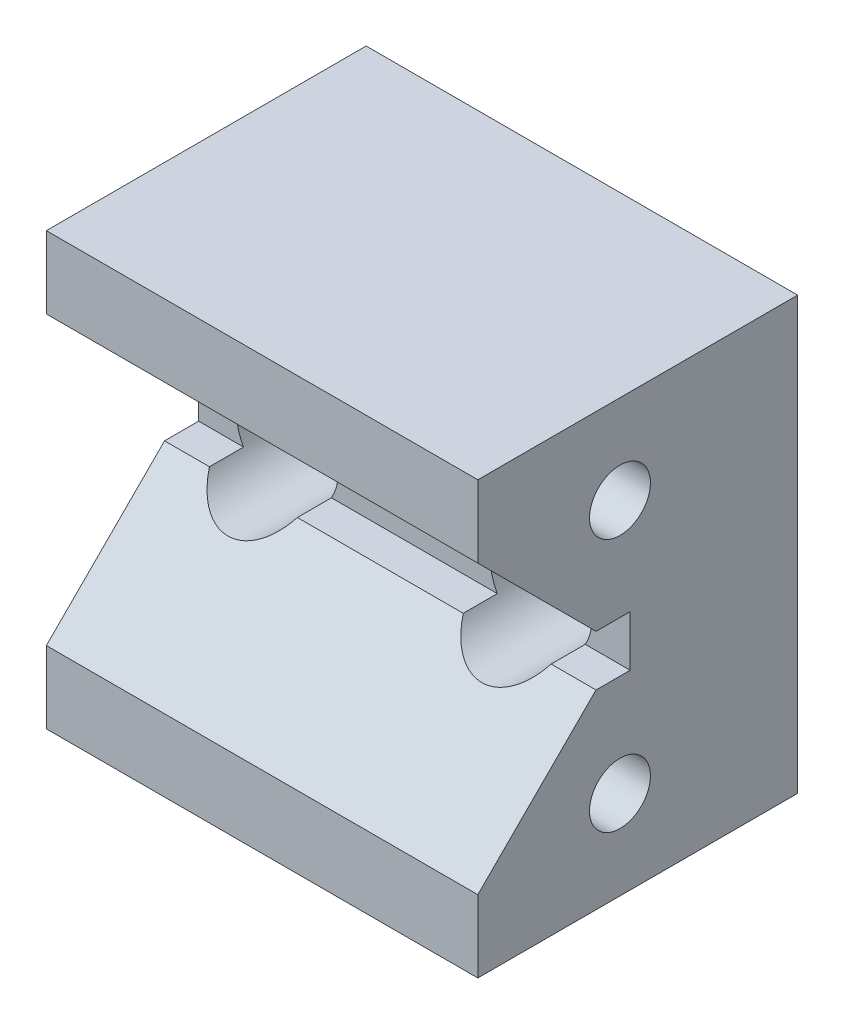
ISO-10303-21;
HEADER;
FILE_DESCRIPTION(('STEP AP214'),'2;1');
FILE_NAME('part.step','',(''),(''),'','','');
FILE_SCHEMA(('AUTOMOTIVE_DESIGN { 1 0 10303 214 1 1 1 1 }'));
ENDSEC;
DATA;
#1=APPLICATION_CONTEXT('core data for automotive mechanical design processes');
#2=APPLICATION_PROTOCOL_DEFINITION('international standard','automotive_design',2000,#1);
#3=PRODUCT_CONTEXT('',#1,'mechanical');
#4=PRODUCT('Part','Part','',(#3));
#5=PRODUCT_RELATED_PRODUCT_CATEGORY('part','',(#4));
#6=PRODUCT_DEFINITION_FORMATION('','',#4);
#7=PRODUCT_DEFINITION_CONTEXT('part definition',#1,'design');
#8=PRODUCT_DEFINITION('design','',#6,#7);
#9=PRODUCT_DEFINITION_SHAPE('','',#8);
#10=(LENGTH_UNIT() NAMED_UNIT(*) SI_UNIT(.MILLI.,.METRE.));
#11=(NAMED_UNIT(*) PLANE_ANGLE_UNIT() SI_UNIT($,.RADIAN.));
#12=(NAMED_UNIT(*) SI_UNIT($,.STERADIAN.) SOLID_ANGLE_UNIT());
#13=UNCERTAINTY_MEASURE_WITH_UNIT(LENGTH_MEASURE(1.E-05),#10,'distance_accuracy_value','');
#14=(GEOMETRIC_REPRESENTATION_CONTEXT(3) GLOBAL_UNCERTAINTY_ASSIGNED_CONTEXT((#13)) GLOBAL_UNIT_ASSIGNED_CONTEXT((#10,
#11,#12)) REPRESENTATION_CONTEXT('',''));
#15=CARTESIAN_POINT('',(0.,0.,0.));
#16=DIRECTION('',(0.,0.,1.));
#17=DIRECTION('',(1.,0.,0.));
#18=AXIS2_PLACEMENT_3D('',#15,#16,#17);
#19=CARTESIAN_POINT('',(67.5,-42.5,0.));
#20=DIRECTION('',(0.,0.,1.));
#21=DIRECTION('',(0.,-1.,0.));
#22=AXIS2_PLACEMENT_3D('',#19,#20,#21);
#23=PLANE('',#22);
#24=CARTESIAN_POINT('',(50.,0.,0.));
#25=DIRECTION('',(0.,0.,-1.));
#26=DIRECTION('',(0.,1.,0.));
#27=AXIS2_PLACEMENT_3D('',#24,#25,#26);
#28=CIRCLE('',#27,6.);
#29=CARTESIAN_POINT('',(50.,6.,0.));
#30=VERTEX_POINT('',#29);
#31=EDGE_CURVE('E272',#30,#30,#28,.T.);
#32=ORIENTED_EDGE('',*,*,#31,.F.);
#33=EDGE_LOOP('',(#32));
#34=FACE_BOUND('',#33,.T.);
#35=DIRECTION('',(-1.,0.,0.));
#36=VECTOR('',#35,1.);
#37=CARTESIAN_POINT('',(67.5,42.5,0.));
#38=LINE('',#37,#36);
#39=CARTESIAN_POINT('',(67.5,42.5,0.));
#40=VERTEX_POINT('',#39);
#41=CARTESIAN_POINT('',(-17.5,42.5,0.));
#42=VERTEX_POINT('',#41);
#43=EDGE_CURVE('E178',#40,#42,#38,.T.);
#44=ORIENTED_EDGE('',*,*,#43,.F.);
#45=DIRECTION('',(0.,1.,0.));
#46=VECTOR('',#45,1.);
#47=CARTESIAN_POINT('',(67.5,-42.5,0.));
#48=LINE('',#47,#46);
#49=CARTESIAN_POINT('',(67.5,-42.5,0.));
#50=VERTEX_POINT('',#49);
#51=EDGE_CURVE('E235',#50,#40,#48,.T.);
#52=ORIENTED_EDGE('',*,*,#51,.F.);
#53=DIRECTION('',(-1.,0.,0.));
#54=VECTOR('',#53,1.);
#55=CARTESIAN_POINT('',(67.5,-42.5,0.));
#56=LINE('',#55,#54);
#57=CARTESIAN_POINT('',(-17.5,-42.5,0.));
#58=VERTEX_POINT('',#57);
#59=EDGE_CURVE('E180',#50,#58,#56,.T.);
#60=ORIENTED_EDGE('',*,*,#59,.T.);
#61=DIRECTION('',(0.,1.,0.));
#62=VECTOR('',#61,1.);
#63=CARTESIAN_POINT('',(-17.5,-42.5,0.));
#64=LINE('',#63,#62);
#65=EDGE_CURVE('E207',#58,#42,#64,.T.);
#66=ORIENTED_EDGE('',*,*,#65,.T.);
#67=EDGE_LOOP('',(#44,#52,#60,#66));
#68=FACE_BOUND('',#67,.T.);
#69=CARTESIAN_POINT('',(0.,0.,0.));
#70=DIRECTION('',(0.,0.,-1.));
#71=DIRECTION('',(0.,1.,0.));
#72=AXIS2_PLACEMENT_3D('',#69,#70,#71);
#73=CIRCLE('',#72,6.);
#74=CARTESIAN_POINT('',(0.,6.,0.));
#75=VERTEX_POINT('',#74);
#76=EDGE_CURVE('E310',#75,#75,#73,.T.);
#77=ORIENTED_EDGE('',*,*,#76,.F.);
#78=EDGE_LOOP('',(#77));
#79=FACE_BOUND('',#78,.T.);
#80=ADVANCED_FACE('F14',(#34,#68,#79),#23,.F.);
#81=CARTESIAN_POINT('',(67.5,28.284,63.));
#82=DIRECTION('',(0.,0.707106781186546,-0.707106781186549));
#83=DIRECTION('',(0.,0.707106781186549,0.707106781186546));
#84=AXIS2_PLACEMENT_3D('',#81,#82,#83);
#85=PLANE('',#84);
#86=CARTESIAN_POINT('',(0.,0.,34.716));
#87=DIRECTION('',(0.,0.707106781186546,-0.707106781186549));
#88=DIRECTION('',(0.,-0.707106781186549,-0.707106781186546));
#89=AXIS2_PLACEMENT_3D('',#86,#87,#88);
#90=ELLIPSE('',#89,14.1421356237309,10.);
#91=CARTESIAN_POINT('',(8.6602540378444,5.,39.716));
#92=VERTEX_POINT('',#91);
#93=CARTESIAN_POINT('',(-8.6602540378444,5.,39.716));
#94=VERTEX_POINT('',#93);
#95=EDGE_CURVE('E328',#92,#94,#90,.F.);
#96=ORIENTED_EDGE('',*,*,#95,.F.);
#97=DIRECTION('',(-1.,0.,0.));
#98=VECTOR('',#97,1.);
#99=CARTESIAN_POINT('',(67.5,5.,39.716));
#100=LINE('',#99,#98);
#101=CARTESIAN_POINT('',(41.3397459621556,5.,39.716));
#102=VERTEX_POINT('',#101);
#103=EDGE_CURVE('E174',#102,#92,#100,.T.);
#104=ORIENTED_EDGE('',*,*,#103,.F.);
#105=CARTESIAN_POINT('',(50.,0.,34.716));
#106=DIRECTION('',(0.,0.707106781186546,-0.707106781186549));
#107=DIRECTION('',(0.,-0.707106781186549,-0.707106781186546));
#108=AXIS2_PLACEMENT_3D('',#105,#106,#107);
#109=ELLIPSE('',#108,14.1421356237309,10.);
#110=CARTESIAN_POINT('',(58.6602540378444,5.,39.716));
#111=VERTEX_POINT('',#110);
#112=EDGE_CURVE('E201',#111,#102,#109,.F.);
#113=ORIENTED_EDGE('',*,*,#112,.F.);
#114=CARTESIAN_POINT('',(67.5,5.,39.716));
#115=VERTEX_POINT('',#114);
#116=EDGE_CURVE('E170',#115,#111,#100,.T.);
#117=ORIENTED_EDGE('',*,*,#116,.F.);
#118=DIRECTION('',(0.,-0.707106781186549,-0.707106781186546));
#119=VECTOR('',#118,1.);
#120=CARTESIAN_POINT('',(67.5,28.284,63.));
#121=LINE('',#120,#119);
#122=CARTESIAN_POINT('',(67.5,28.284,63.));
#123=VERTEX_POINT('',#122);
#124=EDGE_CURVE('E244',#123,#115,#121,.T.);
#125=ORIENTED_EDGE('',*,*,#124,.F.);
#126=DIRECTION('',(-1.,0.,0.));
#127=VECTOR('',#126,1.);
#128=CARTESIAN_POINT('',(67.5,28.284,63.));
#129=LINE('',#128,#127);
#130=CARTESIAN_POINT('',(-17.5,28.284,63.));
#131=VERTEX_POINT('',#130);
#132=EDGE_CURVE('E173',#123,#131,#129,.T.);
#133=ORIENTED_EDGE('',*,*,#132,.T.);
#134=DIRECTION('',(0.,-0.707106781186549,-0.707106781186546));
#135=VECTOR('',#134,1.);
#136=CARTESIAN_POINT('',(-17.5,28.284,63.));
#137=LINE('',#136,#135);
#138=CARTESIAN_POINT('',(-17.5,5.,39.716));
#139=VERTEX_POINT('',#138);
#140=EDGE_CURVE('E221',#131,#139,#137,.T.);
#141=ORIENTED_EDGE('',*,*,#140,.T.);
#142=EDGE_CURVE('E168',#94,#139,#100,.T.);
#143=ORIENTED_EDGE('',*,*,#142,.F.);
#144=EDGE_LOOP('',(#96,#104,#113,#117,#125,#133,#141,#143));
#145=FACE_BOUND('',#144,.T.);
#146=ADVANCED_FACE('F289',(#145),#85,.F.);
#147=CARTESIAN_POINT('',(67.5,5.,33.));
#148=DIRECTION('',(0.,-1.,0.));
#149=DIRECTION('',(0.,0.,-1.));
#150=AXIS2_PLACEMENT_3D('',#147,#148,#149);
#151=PLANE('',#150);
#152=DIRECTION('',(-1.,0.,0.));
#153=VECTOR('',#152,1.);
#154=CARTESIAN_POINT('',(67.5,5.,33.));
#155=LINE('',#154,#153);
#156=CARTESIAN_POINT('',(-8.6602540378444,5.,33.));
#157=VERTEX_POINT('',#156);
#158=CARTESIAN_POINT('',(-17.5,5.,33.));
#159=VERTEX_POINT('',#158);
#160=EDGE_CURVE('E164',#157,#159,#155,.T.);
#161=ORIENTED_EDGE('',*,*,#160,.F.);
#162=DIRECTION('',(0.,0.,-1.));
#163=VECTOR('',#162,1.);
#164=CARTESIAN_POINT('',(-8.6602540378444,5.,0.));
#165=LINE('',#164,#163);
#166=EDGE_CURVE('E325',#157,#94,#165,.F.);
#167=ORIENTED_EDGE('',*,*,#166,.T.);
#168=ORIENTED_EDGE('',*,*,#142,.T.);
#169=DIRECTION('',(0.,0.,1.));
#170=VECTOR('',#169,1.);
#171=CARTESIAN_POINT('',(-17.5,5.,33.));
#172=LINE('',#171,#170);
#173=EDGE_CURVE('E224',#159,#139,#172,.T.);
#174=ORIENTED_EDGE('',*,*,#173,.F.);
#175=EDGE_LOOP('',(#161,#167,#168,#174));
#176=FACE_BOUND('',#175,.T.);
#177=ADVANCED_FACE('F378',(#176),#151,.T.);
#178=ORIENTED_EDGE('',*,*,#103,.T.);
#179=DIRECTION('',(0.,0.,-1.));
#180=VECTOR('',#179,1.);
#181=CARTESIAN_POINT('',(8.6602540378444,5.,0.));
#182=LINE('',#181,#180);
#183=CARTESIAN_POINT('',(8.66025403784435,5.,33.));
#184=VERTEX_POINT('',#183);
#185=EDGE_CURVE('E322',#92,#184,#182,.T.);
#186=ORIENTED_EDGE('',*,*,#185,.T.);
#187=CARTESIAN_POINT('',(41.3397459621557,5.,33.));
#188=VERTEX_POINT('',#187);
#189=EDGE_CURVE('E169',#188,#184,#155,.T.);
#190=ORIENTED_EDGE('',*,*,#189,.F.);
#191=DIRECTION('',(0.,0.,-1.));
#192=VECTOR('',#191,1.);
#193=CARTESIAN_POINT('',(41.3397459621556,5.,0.));
#194=LINE('',#193,#192);
#195=EDGE_CURVE('E278',#188,#102,#194,.F.);
#196=ORIENTED_EDGE('',*,*,#195,.T.);
#197=EDGE_LOOP('',(#178,#186,#190,#196));
#198=FACE_BOUND('',#197,.T.);
#199=ADVANCED_FACE('F376',(#198),#151,.T.);
#200=CARTESIAN_POINT('',(67.5,-5.,33.));
#201=DIRECTION('',(0.,0.,1.));
#202=DIRECTION('',(0.,-1.,0.));
#203=AXIS2_PLACEMENT_3D('',#200,#201,#202);
#204=PLANE('',#203);
#205=DIRECTION('',(-1.,0.,0.));
#206=VECTOR('',#205,1.);
#207=CARTESIAN_POINT('',(67.5,-5.,33.));
#208=LINE('',#207,#206);
#209=CARTESIAN_POINT('',(-8.6602540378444,-5.,33.));
#210=VERTEX_POINT('',#209);
#211=CARTESIAN_POINT('',(-17.5,-5.,33.));
#212=VERTEX_POINT('',#211);
#213=EDGE_CURVE('E156',#210,#212,#208,.T.);
#214=ORIENTED_EDGE('',*,*,#213,.F.);
#215=CARTESIAN_POINT('',(0.,0.,33.));
#216=DIRECTION('',(0.,0.,1.));
#217=DIRECTION('',(0.,-1.,0.));
#218=AXIS2_PLACEMENT_3D('',#215,#216,#217);
#219=CIRCLE('',#218,10.);
#220=EDGE_CURVE('E321',#210,#157,#219,.F.);
#221=ORIENTED_EDGE('',*,*,#220,.T.);
#222=ORIENTED_EDGE('',*,*,#160,.T.);
#223=DIRECTION('',(0.,1.,0.));
#224=VECTOR('',#223,1.);
#225=CARTESIAN_POINT('',(-17.5,-5.,33.));
#226=LINE('',#225,#224);
#227=EDGE_CURVE('E227',#212,#159,#226,.T.);
#228=ORIENTED_EDGE('',*,*,#227,.F.);
#229=EDGE_LOOP('',(#214,#221,#222,#228));
#230=FACE_BOUND('',#229,.T.);
#231=ADVANCED_FACE('F372',(#230),#204,.T.);
#232=ORIENTED_EDGE('',*,*,#189,.T.);
#233=CARTESIAN_POINT('',(8.66025403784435,-5.,33.));
#234=VERTEX_POINT('',#233);
#235=EDGE_CURVE('E149',#184,#234,#219,.F.);
#236=ORIENTED_EDGE('',*,*,#235,.T.);
#237=CARTESIAN_POINT('',(41.3397459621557,-5.,33.));
#238=VERTEX_POINT('',#237);
#239=EDGE_CURVE('E148',#238,#234,#208,.T.);
#240=ORIENTED_EDGE('',*,*,#239,.F.);
#241=CARTESIAN_POINT('',(50.,0.,33.));
#242=DIRECTION('',(0.,0.,1.));
#243=DIRECTION('',(0.,-1.,0.));
#244=AXIS2_PLACEMENT_3D('',#241,#242,#243);
#245=CIRCLE('',#244,10.);
#246=EDGE_CURVE('E270',#238,#188,#245,.F.);
#247=ORIENTED_EDGE('',*,*,#246,.T.);
#248=EDGE_LOOP('',(#232,#236,#240,#247));
#249=FACE_BOUND('',#248,.T.);
#250=ADVANCED_FACE('F375',(#249),#204,.T.);
#251=CARTESIAN_POINT('',(67.5,-5.,39.716));
#252=DIRECTION('',(0.,1.,0.));
#253=DIRECTION('',(0.,0.,1.));
#254=AXIS2_PLACEMENT_3D('',#251,#252,#253);
#255=PLANE('',#254);
#256=ORIENTED_EDGE('',*,*,#239,.T.);
#257=DIRECTION('',(0.,0.,-1.));
#258=VECTOR('',#257,1.);
#259=CARTESIAN_POINT('',(8.66025403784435,-5.,0.));
#260=LINE('',#259,#258);
#261=CARTESIAN_POINT('',(8.66025403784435,-5.,39.716));
#262=VERTEX_POINT('',#261);
#263=EDGE_CURVE('E137',#234,#262,#260,.F.);
#264=ORIENTED_EDGE('',*,*,#263,.T.);
#265=DIRECTION('',(-1.,0.,0.));
#266=VECTOR('',#265,1.);
#267=CARTESIAN_POINT('',(67.5,-5.,39.716));
#268=LINE('',#267,#266);
#269=CARTESIAN_POINT('',(41.3397459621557,-5.,39.716));
#270=VERTEX_POINT('',#269);
#271=EDGE_CURVE('E146',#270,#262,#268,.T.);
#272=ORIENTED_EDGE('',*,*,#271,.F.);
#273=DIRECTION('',(0.,0.,-1.));
#274=VECTOR('',#273,1.);
#275=CARTESIAN_POINT('',(41.3397459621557,-5.,0.));
#276=LINE('',#275,#274);
#277=EDGE_CURVE('E36',#270,#238,#276,.T.);
#278=ORIENTED_EDGE('',*,*,#277,.T.);
#279=EDGE_LOOP('',(#256,#264,#272,#278));
#280=FACE_BOUND('',#279,.T.);
#281=ADVANCED_FACE('F145',(#280),#255,.T.);
#282=CARTESIAN_POINT('',(-8.6602540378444,-5.,39.716));
#283=VERTEX_POINT('',#282);
#284=CARTESIAN_POINT('',(-17.5,-5.,39.716));
#285=VERTEX_POINT('',#284);
#286=EDGE_CURVE('E154',#283,#285,#268,.T.);
#287=ORIENTED_EDGE('',*,*,#286,.F.);
#288=DIRECTION('',(0.,0.,-1.));
#289=VECTOR('',#288,1.);
#290=CARTESIAN_POINT('',(-8.6602540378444,-5.,0.));
#291=LINE('',#290,#289);
#292=EDGE_CURVE('E29',#283,#210,#291,.T.);
#293=ORIENTED_EDGE('',*,*,#292,.T.);
#294=ORIENTED_EDGE('',*,*,#213,.T.);
#295=DIRECTION('',(0.,0.,-1.));
#296=VECTOR('',#295,1.);
#297=CARTESIAN_POINT('',(-17.5,-5.,39.716));
#298=LINE('',#297,#296);
#299=EDGE_CURVE('E230',#285,#212,#298,.T.);
#300=ORIENTED_EDGE('',*,*,#299,.F.);
#301=EDGE_LOOP('',(#287,#293,#294,#300));
#302=FACE_BOUND('',#301,.T.);
#303=ADVANCED_FACE('F368',(#302),#255,.T.);
#304=CARTESIAN_POINT('',(67.5,-28.284,63.));
#305=DIRECTION('',(0.,0.707106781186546,0.707106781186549));
#306=DIRECTION('',(0.,-0.707106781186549,0.707106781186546));
#307=AXIS2_PLACEMENT_3D('',#304,#305,#306);
#308=PLANE('',#307);
#309=ORIENTED_EDGE('',*,*,#271,.T.);
#310=CARTESIAN_POINT('',(0.,0.,34.716));
#311=DIRECTION('',(0.,0.707106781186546,0.707106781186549));
#312=DIRECTION('',(0.,0.707106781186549,-0.707106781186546));
#313=AXIS2_PLACEMENT_3D('',#310,#311,#312);
#314=ELLIPSE('',#313,14.1421356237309,10.);
#315=EDGE_CURVE('E9',#262,#283,#314,.F.);
#316=ORIENTED_EDGE('',*,*,#315,.T.);
#317=ORIENTED_EDGE('',*,*,#286,.T.);
#318=DIRECTION('',(0.,0.707106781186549,-0.707106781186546));
#319=VECTOR('',#318,1.);
#320=CARTESIAN_POINT('',(-17.5,-28.284,63.));
#321=LINE('',#320,#319);
#322=CARTESIAN_POINT('',(-17.5,-28.284,63.));
#323=VERTEX_POINT('',#322);
#324=EDGE_CURVE('E200',#323,#285,#321,.T.);
#325=ORIENTED_EDGE('',*,*,#324,.F.);
#326=DIRECTION('',(-1.,0.,0.));
#327=VECTOR('',#326,1.);
#328=CARTESIAN_POINT('',(67.5,-28.284,63.));
#329=LINE('',#328,#327);
#330=CARTESIAN_POINT('',(67.5,-28.284,63.));
#331=VERTEX_POINT('',#330);
#332=EDGE_CURVE('E157',#331,#323,#329,.T.);
#333=ORIENTED_EDGE('',*,*,#332,.F.);
#334=DIRECTION('',(0.,0.707106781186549,-0.707106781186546));
#335=VECTOR('',#334,1.);
#336=CARTESIAN_POINT('',(67.5,-28.284,63.));
#337=LINE('',#336,#335);
#338=CARTESIAN_POINT('',(67.5,-5.,39.716));
#339=VERTEX_POINT('',#338);
#340=EDGE_CURVE('E210',#331,#339,#337,.T.);
#341=ORIENTED_EDGE('',*,*,#340,.T.);
#342=CARTESIAN_POINT('',(58.6602540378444,-5.,39.716));
#343=VERTEX_POINT('',#342);
#344=EDGE_CURVE('E153',#339,#343,#268,.T.);
#345=ORIENTED_EDGE('',*,*,#344,.T.);
#346=CARTESIAN_POINT('',(50.,0.,34.716));
#347=DIRECTION('',(0.,0.707106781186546,0.707106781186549));
#348=DIRECTION('',(0.,0.707106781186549,-0.707106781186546));
#349=AXIS2_PLACEMENT_3D('',#346,#347,#348);
#350=ELLIPSE('',#349,14.1421356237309,10.);
#351=EDGE_CURVE('E22',#343,#270,#350,.F.);
#352=ORIENTED_EDGE('',*,*,#351,.T.);
#353=EDGE_LOOP('',(#309,#316,#317,#325,#333,#341,#345,#352));
#354=FACE_BOUND('',#353,.T.);
#355=ADVANCED_FACE('F151',(#354),#308,.T.);
#356=ORIENTED_EDGE('',*,*,#116,.T.);
#357=DIRECTION('',(0.,0.,-1.));
#358=VECTOR('',#357,1.);
#359=CARTESIAN_POINT('',(58.6602540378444,5.,0.));
#360=LINE('',#359,#358);
#361=CARTESIAN_POINT('',(58.6602540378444,5.,33.));
#362=VERTEX_POINT('',#361);
#363=EDGE_CURVE('E276',#111,#362,#360,.T.);
#364=ORIENTED_EDGE('',*,*,#363,.T.);
#365=CARTESIAN_POINT('',(67.5,5.,33.));
#366=VERTEX_POINT('',#365);
#367=EDGE_CURVE('E165',#366,#362,#155,.T.);
#368=ORIENTED_EDGE('',*,*,#367,.F.);
#369=DIRECTION('',(0.,0.,1.));
#370=VECTOR('',#369,1.);
#371=CARTESIAN_POINT('',(67.5,5.,33.));
#372=LINE('',#371,#370);
#373=EDGE_CURVE('E247',#366,#115,#372,.T.);
#374=ORIENTED_EDGE('',*,*,#373,.T.);
#375=EDGE_LOOP('',(#356,#364,#368,#374));
#376=FACE_BOUND('',#375,.T.);
#377=ADVANCED_FACE('F292',(#376),#151,.T.);
#378=ORIENTED_EDGE('',*,*,#367,.T.);
#379=CARTESIAN_POINT('',(58.6602540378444,-5.,33.));
#380=VERTEX_POINT('',#379);
#381=EDGE_CURVE('E268',#362,#380,#245,.F.);
#382=ORIENTED_EDGE('',*,*,#381,.T.);
#383=CARTESIAN_POINT('',(67.5,-5.,33.));
#384=VERTEX_POINT('',#383);
#385=EDGE_CURVE('E161',#384,#380,#208,.T.);
#386=ORIENTED_EDGE('',*,*,#385,.F.);
#387=DIRECTION('',(0.,1.,0.));
#388=VECTOR('',#387,1.);
#389=CARTESIAN_POINT('',(67.5,-5.,33.));
#390=LINE('',#389,#388);
#391=EDGE_CURVE('E250',#384,#366,#390,.T.);
#392=ORIENTED_EDGE('',*,*,#391,.T.);
#393=EDGE_LOOP('',(#378,#382,#386,#392));
#394=FACE_BOUND('',#393,.T.);
#395=ADVANCED_FACE('F371',(#394),#204,.T.);
#396=ORIENTED_EDGE('',*,*,#385,.T.);
#397=DIRECTION('',(0.,0.,-1.));
#398=VECTOR('',#397,1.);
#399=CARTESIAN_POINT('',(58.6602540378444,-5.,0.));
#400=LINE('',#399,#398);
#401=EDGE_CURVE('E266',#380,#343,#400,.F.);
#402=ORIENTED_EDGE('',*,*,#401,.T.);
#403=ORIENTED_EDGE('',*,*,#344,.F.);
#404=DIRECTION('',(0.,0.,-1.));
#405=VECTOR('',#404,1.);
#406=CARTESIAN_POINT('',(67.5,-5.,39.716));
#407=LINE('',#406,#405);
#408=EDGE_CURVE('E253',#339,#384,#407,.T.);
#409=ORIENTED_EDGE('',*,*,#408,.T.);
#410=EDGE_LOOP('',(#396,#402,#403,#409));
#411=FACE_BOUND('',#410,.T.);
#412=ADVANCED_FACE('F264',(#411),#255,.T.);
#413=CARTESIAN_POINT('',(67.5,-42.5,63.));
#414=DIRECTION('',(0.,0.,1.));
#415=DIRECTION('',(0.,-1.,0.));
#416=AXIS2_PLACEMENT_3D('',#413,#414,#415);
#417=PLANE('',#416);
#418=DIRECTION('',(-1.,0.,0.));
#419=VECTOR('',#418,1.);
#420=CARTESIAN_POINT('',(67.5,-42.5,63.));
#421=LINE('',#420,#419);
#422=CARTESIAN_POINT('',(67.5,-42.5,63.));
#423=VERTEX_POINT('',#422);
#424=CARTESIAN_POINT('',(-17.5,-42.5,63.));
#425=VERTEX_POINT('',#424);
#426=EDGE_CURVE('E182',#423,#425,#421,.T.);
#427=ORIENTED_EDGE('',*,*,#426,.F.);
#428=DIRECTION('',(0.,1.,0.));
#429=VECTOR('',#428,1.);
#430=CARTESIAN_POINT('',(67.5,-42.5,63.));
#431=LINE('',#430,#429);
#432=EDGE_CURVE('E208',#423,#331,#431,.T.);
#433=ORIENTED_EDGE('',*,*,#432,.T.);
#434=ORIENTED_EDGE('',*,*,#332,.T.);
#435=DIRECTION('',(0.,1.,0.));
#436=VECTOR('',#435,1.);
#437=CARTESIAN_POINT('',(-17.5,-42.5,63.));
#438=LINE('',#437,#436);
#439=EDGE_CURVE('E195',#425,#323,#438,.T.);
#440=ORIENTED_EDGE('',*,*,#439,.F.);
#441=EDGE_LOOP('',(#427,#433,#434,#440));
#442=FACE_BOUND('',#441,.T.);
#443=ADVANCED_FACE('F196',(#442),#417,.T.);
#444=CARTESIAN_POINT('',(67.5,-42.5,63.));
#445=DIRECTION('',(0.,1.,0.));
#446=DIRECTION('',(0.,0.,1.));
#447=AXIS2_PLACEMENT_3D('',#444,#445,#446);
#448=PLANE('',#447);
#449=ORIENTED_EDGE('',*,*,#59,.F.);
#450=DIRECTION('',(0.,0.,-1.));
#451=VECTOR('',#450,1.);
#452=CARTESIAN_POINT('',(67.5,-42.5,63.));
#453=LINE('',#452,#451);
#454=EDGE_CURVE('E190',#423,#50,#453,.T.);
#455=ORIENTED_EDGE('',*,*,#454,.F.);
#456=ORIENTED_EDGE('',*,*,#426,.T.);
#457=DIRECTION('',(0.,0.,-1.));
#458=VECTOR('',#457,1.);
#459=CARTESIAN_POINT('',(-17.5,-42.5,63.));
#460=LINE('',#459,#458);
#461=EDGE_CURVE('E188',#425,#58,#460,.T.);
#462=ORIENTED_EDGE('',*,*,#461,.T.);
#463=EDGE_LOOP('',(#449,#455,#456,#462));
#464=FACE_BOUND('',#463,.T.);
#465=ADVANCED_FACE('F16',(#464),#448,.F.);
#466=CARTESIAN_POINT('',(67.5,42.5,0.));
#467=DIRECTION('',(0.,-1.,0.));
#468=DIRECTION('',(0.,0.,-1.));
#469=AXIS2_PLACEMENT_3D('',#466,#467,#468);
#470=PLANE('',#469);
#471=DIRECTION('',(-1.,0.,0.));
#472=VECTOR('',#471,1.);
#473=CARTESIAN_POINT('',(67.5,42.5,63.));
#474=LINE('',#473,#472);
#475=CARTESIAN_POINT('',(67.5,42.5,63.));
#476=VERTEX_POINT('',#475);
#477=CARTESIAN_POINT('',(-17.5,42.5,63.));
#478=VERTEX_POINT('',#477);
#479=EDGE_CURVE('E176',#476,#478,#474,.T.);
#480=ORIENTED_EDGE('',*,*,#479,.F.);
#481=DIRECTION('',(0.,0.,1.));
#482=VECTOR('',#481,1.);
#483=CARTESIAN_POINT('',(67.5,42.5,0.));
#484=LINE('',#483,#482);
#485=EDGE_CURVE('E238',#40,#476,#484,.T.);
#486=ORIENTED_EDGE('',*,*,#485,.F.);
#487=ORIENTED_EDGE('',*,*,#43,.T.);
#488=DIRECTION('',(0.,0.,1.));
#489=VECTOR('',#488,1.);
#490=CARTESIAN_POINT('',(-17.5,42.5,0.));
#491=LINE('',#490,#489);
#492=EDGE_CURVE('E211',#42,#478,#491,.T.);
#493=ORIENTED_EDGE('',*,*,#492,.T.);
#494=EDGE_LOOP('',(#480,#486,#487,#493));
#495=FACE_BOUND('',#494,.T.);
#496=ADVANCED_FACE('F302',(#495),#470,.F.);
#497=CARTESIAN_POINT('',(67.5,42.5,63.));
#498=DIRECTION('',(0.,0.,-1.));
#499=DIRECTION('',(0.,1.,0.));
#500=AXIS2_PLACEMENT_3D('',#497,#498,#499);
#501=PLANE('',#500);
#502=ORIENTED_EDGE('',*,*,#132,.F.);
#503=DIRECTION('',(0.,-1.,0.));
#504=VECTOR('',#503,1.);
#505=CARTESIAN_POINT('',(67.5,42.5,63.));
#506=LINE('',#505,#504);
#507=EDGE_CURVE('E241',#476,#123,#506,.T.);
#508=ORIENTED_EDGE('',*,*,#507,.F.);
#509=ORIENTED_EDGE('',*,*,#479,.T.);
#510=DIRECTION('',(0.,-1.,0.));
#511=VECTOR('',#510,1.);
#512=CARTESIAN_POINT('',(-17.5,42.5,63.));
#513=LINE('',#512,#511);
#514=EDGE_CURVE('E218',#478,#131,#513,.T.);
#515=ORIENTED_EDGE('',*,*,#514,.T.);
#516=EDGE_LOOP('',(#502,#508,#509,#515));
#517=FACE_BOUND('',#516,.T.);
#518=ADVANCED_FACE('F299',(#517),#501,.F.);
#519=CARTESIAN_POINT('',(67.5,-42.5,63.));
#520=DIRECTION('',(-1.,0.,0.));
#521=DIRECTION('',(0.,0.,-1.));
#522=AXIS2_PLACEMENT_3D('',#519,#520,#521);
#523=PLANE('',#522);
#524=CARTESIAN_POINT('',(67.5,-25.,35.));
#525=DIRECTION('',(1.,0.,0.));
#526=DIRECTION('',(0.,0.,1.));
#527=AXIS2_PLACEMENT_3D('',#524,#525,#526);
#528=CIRCLE('',#527,6.);
#529=CARTESIAN_POINT('',(67.5,-25.,41.));
#530=VERTEX_POINT('',#529);
#531=EDGE_CURVE('E594',#530,#530,#528,.T.);
#532=ORIENTED_EDGE('',*,*,#531,.F.);
#533=EDGE_LOOP('',(#532));
#534=FACE_BOUND('',#533,.T.);
#535=CARTESIAN_POINT('',(67.5,25.,35.));
#536=DIRECTION('',(1.,0.,0.));
#537=DIRECTION('',(0.,0.,1.));
#538=AXIS2_PLACEMENT_3D('',#535,#536,#537);
#539=CIRCLE('',#538,6.);
#540=CARTESIAN_POINT('',(67.5,25.,41.));
#541=VERTEX_POINT('',#540);
#542=EDGE_CURVE('E593',#541,#541,#539,.T.);
#543=ORIENTED_EDGE('',*,*,#542,.F.);
#544=EDGE_LOOP('',(#543));
#545=FACE_BOUND('',#544,.T.);
#546=ORIENTED_EDGE('',*,*,#432,.F.);
#547=ORIENTED_EDGE('',*,*,#454,.T.);
#548=ORIENTED_EDGE('',*,*,#51,.T.);
#549=ORIENTED_EDGE('',*,*,#485,.T.);
#550=ORIENTED_EDGE('',*,*,#507,.T.);
#551=ORIENTED_EDGE('',*,*,#124,.T.);
#552=ORIENTED_EDGE('',*,*,#373,.F.);
#553=ORIENTED_EDGE('',*,*,#391,.F.);
#554=ORIENTED_EDGE('',*,*,#408,.F.);
#555=ORIENTED_EDGE('',*,*,#340,.F.);
#556=EDGE_LOOP('',(#546,#547,#548,#549,#550,#551,#552,#553,#554,#555));
#557=FACE_BOUND('',#556,.T.);
#558=ADVANCED_FACE('F261',(#534,#545,#557),#523,.F.);
#559=CARTESIAN_POINT('',(-17.5,-42.5,63.));
#560=DIRECTION('',(-1.,0.,0.));
#561=DIRECTION('',(0.,0.,-1.));
#562=AXIS2_PLACEMENT_3D('',#559,#560,#561);
#563=PLANE('',#562);
#564=ORIENTED_EDGE('',*,*,#439,.T.);
#565=ORIENTED_EDGE('',*,*,#324,.T.);
#566=ORIENTED_EDGE('',*,*,#299,.T.);
#567=ORIENTED_EDGE('',*,*,#227,.T.);
#568=ORIENTED_EDGE('',*,*,#173,.T.);
#569=ORIENTED_EDGE('',*,*,#140,.F.);
#570=ORIENTED_EDGE('',*,*,#514,.F.);
#571=ORIENTED_EDGE('',*,*,#492,.F.);
#572=ORIENTED_EDGE('',*,*,#65,.F.);
#573=ORIENTED_EDGE('',*,*,#461,.F.);
#574=EDGE_LOOP('',(#564,#565,#566,#567,#568,#569,#570,#571,#572,#573));
#575=FACE_BOUND('',#574,.T.);
#576=ADVANCED_FACE('F204',(#575),#563,.T.);
#577=CARTESIAN_POINT('',(50.,0.,0.));
#578=DIRECTION('',(0.,0.,-1.));
#579=DIRECTION('',(0.,1.,0.));
#580=AXIS2_PLACEMENT_3D('',#577,#578,#579);
#581=CYLINDRICAL_SURFACE('',#580,10.);
#582=CARTESIAN_POINT('',(50.,0.,22.));
#583=DIRECTION('',(0.,0.,-1.));
#584=DIRECTION('',(0.,1.,0.));
#585=AXIS2_PLACEMENT_3D('',#582,#583,#584);
#586=CIRCLE('',#585,10.);
#587=CARTESIAN_POINT('',(50.,10.,22.));
#588=VERTEX_POINT('',#587);
#589=EDGE_CURVE('E330',#588,#588,#586,.T.);
#590=ORIENTED_EDGE('',*,*,#589,.T.);
#591=EDGE_LOOP('',(#590));
#592=FACE_BOUND('',#591,.T.);
#593=ORIENTED_EDGE('',*,*,#112,.T.);
#594=ORIENTED_EDGE('',*,*,#195,.F.);
#595=ORIENTED_EDGE('',*,*,#246,.F.);
#596=ORIENTED_EDGE('',*,*,#277,.F.);
#597=ORIENTED_EDGE('',*,*,#351,.F.);
#598=ORIENTED_EDGE('',*,*,#401,.F.);
#599=ORIENTED_EDGE('',*,*,#381,.F.);
#600=ORIENTED_EDGE('',*,*,#363,.F.);
#601=EDGE_LOOP('',(#593,#594,#595,#596,#597,#598,#599,#600));
#602=FACE_BOUND('',#601,.T.);
#603=ADVANCED_FACE('F285',(#592,#602),#581,.F.);
#604=CARTESIAN_POINT('',(50.,0.,0.));
#605=DIRECTION('',(0.,0.,-1.));
#606=DIRECTION('',(0.,1.,0.));
#607=AXIS2_PLACEMENT_3D('',#604,#605,#606);
#608=CYLINDRICAL_SURFACE('',#607,6.);
#609=ORIENTED_EDGE('',*,*,#31,.T.);
#610=EDGE_LOOP('',(#609));
#611=FACE_BOUND('',#610,.T.);
#612=CARTESIAN_POINT('',(50.,0.,22.));
#613=DIRECTION('',(0.,0.,-1.));
#614=DIRECTION('',(0.,1.,0.));
#615=AXIS2_PLACEMENT_3D('',#612,#613,#614);
#616=CIRCLE('',#615,6.);
#617=CARTESIAN_POINT('',(50.,6.,22.));
#618=VERTEX_POINT('',#617);
#619=EDGE_CURVE('E333',#618,#618,#616,.T.);
#620=ORIENTED_EDGE('',*,*,#619,.F.);
#621=EDGE_LOOP('',(#620));
#622=FACE_BOUND('',#621,.T.);
#623=ADVANCED_FACE('F338',(#611,#622),#608,.F.);
#624=CARTESIAN_POINT('',(50.,-10.,22.));
#625=DIRECTION('',(0.,0.,1.));
#626=DIRECTION('',(0.,-1.,0.));
#627=AXIS2_PLACEMENT_3D('',#624,#625,#626);
#628=PLANE('',#627);
#629=ORIENTED_EDGE('',*,*,#619,.T.);
#630=EDGE_LOOP('',(#629));
#631=FACE_BOUND('',#630,.T.);
#632=ORIENTED_EDGE('',*,*,#589,.F.);
#633=EDGE_LOOP('',(#632));
#634=FACE_BOUND('',#633,.T.);
#635=ADVANCED_FACE('F341',(#631,#634),#628,.T.);
#636=CARTESIAN_POINT('',(0.,0.,0.));
#637=DIRECTION('',(0.,0.,-1.));
#638=DIRECTION('',(0.,1.,0.));
#639=AXIS2_PLACEMENT_3D('',#636,#637,#638);
#640=CYLINDRICAL_SURFACE('',#639,10.);
#641=CARTESIAN_POINT('',(0.,0.,22.));
#642=DIRECTION('',(0.,0.,-1.));
#643=DIRECTION('',(0.,1.,0.));
#644=AXIS2_PLACEMENT_3D('',#641,#642,#643);
#645=CIRCLE('',#644,10.);
#646=CARTESIAN_POINT('',(0.,10.,22.));
#647=VERTEX_POINT('',#646);
#648=EDGE_CURVE('E316',#647,#647,#645,.T.);
#649=ORIENTED_EDGE('',*,*,#648,.T.);
#650=EDGE_LOOP('',(#649));
#651=FACE_BOUND('',#650,.T.);
#652=ORIENTED_EDGE('',*,*,#95,.T.);
#653=ORIENTED_EDGE('',*,*,#166,.F.);
#654=ORIENTED_EDGE('',*,*,#220,.F.);
#655=ORIENTED_EDGE('',*,*,#292,.F.);
#656=ORIENTED_EDGE('',*,*,#315,.F.);
#657=ORIENTED_EDGE('',*,*,#263,.F.);
#658=ORIENTED_EDGE('',*,*,#235,.F.);
#659=ORIENTED_EDGE('',*,*,#185,.F.);
#660=EDGE_LOOP('',(#652,#653,#654,#655,#656,#657,#658,#659));
#661=FACE_BOUND('',#660,.T.);
#662=ADVANCED_FACE('F136',(#651,#661),#640,.F.);
#663=CARTESIAN_POINT('',(0.,0.,0.));
#664=DIRECTION('',(0.,0.,-1.));
#665=DIRECTION('',(0.,1.,0.));
#666=AXIS2_PLACEMENT_3D('',#663,#664,#665);
#667=CYLINDRICAL_SURFACE('',#666,6.);
#668=ORIENTED_EDGE('',*,*,#76,.T.);
#669=EDGE_LOOP('',(#668));
#670=FACE_BOUND('',#669,.T.);
#671=CARTESIAN_POINT('',(0.,0.,22.));
#672=DIRECTION('',(0.,0.,-1.));
#673=DIRECTION('',(0.,1.,0.));
#674=AXIS2_PLACEMENT_3D('',#671,#672,#673);
#675=CIRCLE('',#674,6.);
#676=CARTESIAN_POINT('',(0.,6.,22.));
#677=VERTEX_POINT('',#676);
#678=EDGE_CURVE('E312',#677,#677,#675,.T.);
#679=ORIENTED_EDGE('',*,*,#678,.F.);
#680=EDGE_LOOP('',(#679));
#681=FACE_BOUND('',#680,.T.);
#682=ADVANCED_FACE('F358',(#670,#681),#667,.F.);
#683=CARTESIAN_POINT('',(0.,-10.,22.));
#684=DIRECTION('',(0.,0.,1.));
#685=DIRECTION('',(0.,-1.,0.));
#686=AXIS2_PLACEMENT_3D('',#683,#684,#685);
#687=PLANE('',#686);
#688=ORIENTED_EDGE('',*,*,#678,.T.);
#689=EDGE_LOOP('',(#688));
#690=FACE_BOUND('',#689,.T.);
#691=ORIENTED_EDGE('',*,*,#648,.F.);
#692=EDGE_LOOP('',(#691));
#693=FACE_BOUND('',#692,.T.);
#694=ADVANCED_FACE('F536',(#690,#693),#687,.T.);
#695=CARTESIAN_POINT('',(37.5,25.,35.));
#696=DIRECTION('',(1.,0.,0.));
#697=DIRECTION('',(0.,0.,1.));
#698=AXIS2_PLACEMENT_3D('',#695,#696,#697);
#699=CYLINDRICAL_SURFACE('',#698,6.);
#700=CARTESIAN_POINT('',(37.5,25.,35.));
#701=DIRECTION('',(1.,0.,0.));
#702=DIRECTION('',(0.,0.,1.));
#703=AXIS2_PLACEMENT_3D('',#700,#701,#702);
#704=CIRCLE('',#703,6.);
#705=CARTESIAN_POINT('',(37.5,25.,41.));
#706=VERTEX_POINT('',#705);
#707=EDGE_CURVE('E597',#706,#706,#704,.T.);
#708=ORIENTED_EDGE('',*,*,#707,.F.);
#709=EDGE_LOOP('',(#708));
#710=FACE_BOUND('',#709,.T.);
#711=ORIENTED_EDGE('',*,*,#542,.T.);
#712=EDGE_LOOP('',(#711));
#713=FACE_BOUND('',#712,.T.);
#714=ADVANCED_FACE('F543',(#710,#713),#699,.F.);
#715=CARTESIAN_POINT('',(37.5,25.,35.));
#716=DIRECTION('',(1.,0.,0.));
#717=DIRECTION('',(0.,0.,1.));
#718=AXIS2_PLACEMENT_3D('',#715,#716,#717);
#719=PLANE('',#718);
#720=ORIENTED_EDGE('',*,*,#707,.T.);
#721=EDGE_LOOP('',(#720));
#722=FACE_BOUND('',#721,.T.);
#723=ADVANCED_FACE('F545',(#722),#719,.T.);
#724=CARTESIAN_POINT('',(37.5,-25.,35.));
#725=DIRECTION('',(1.,0.,0.));
#726=DIRECTION('',(0.,0.,1.));
#727=AXIS2_PLACEMENT_3D('',#724,#725,#726);
#728=CYLINDRICAL_SURFACE('',#727,6.);
#729=CARTESIAN_POINT('',(37.5,-25.,35.));
#730=DIRECTION('',(1.,0.,0.));
#731=DIRECTION('',(0.,0.,1.));
#732=AXIS2_PLACEMENT_3D('',#729,#730,#731);
#733=CIRCLE('',#732,6.);
#734=CARTESIAN_POINT('',(37.5,-25.,41.));
#735=VERTEX_POINT('',#734);
#736=EDGE_CURVE('E592',#735,#735,#733,.T.);
#737=ORIENTED_EDGE('',*,*,#736,.F.);
#738=EDGE_LOOP('',(#737));
#739=FACE_BOUND('',#738,.T.);
#740=ORIENTED_EDGE('',*,*,#531,.T.);
#741=EDGE_LOOP('',(#740));
#742=FACE_BOUND('',#741,.T.);
#743=ADVANCED_FACE('F561',(#739,#742),#728,.F.);
#744=CARTESIAN_POINT('',(37.5,-25.,35.));
#745=DIRECTION('',(1.,0.,0.));
#746=DIRECTION('',(0.,0.,1.));
#747=AXIS2_PLACEMENT_3D('',#744,#745,#746);
#748=PLANE('',#747);
#749=ORIENTED_EDGE('',*,*,#736,.T.);
#750=EDGE_LOOP('',(#749));
#751=FACE_BOUND('',#750,.T.);
#752=ADVANCED_FACE('F554',(#751),#748,.T.);
#753=CLOSED_SHELL('',(#80,#146,#177,#199,#231,#250,#281,#303,#355,#377,#395,#412,#443,#465,#496,
#518,#558,#576,#603,#623,#635,#662,#682,#694,#714,#723,#743,#752));
#754=MANIFOLD_SOLID_BREP('B1',#753);
#755=ADVANCED_BREP_SHAPE_REPRESENTATION('',(#18,#754),#14);
#756=SHAPE_DEFINITION_REPRESENTATION(#9,#755);
ENDSEC;
END-ISO-10303-21;
